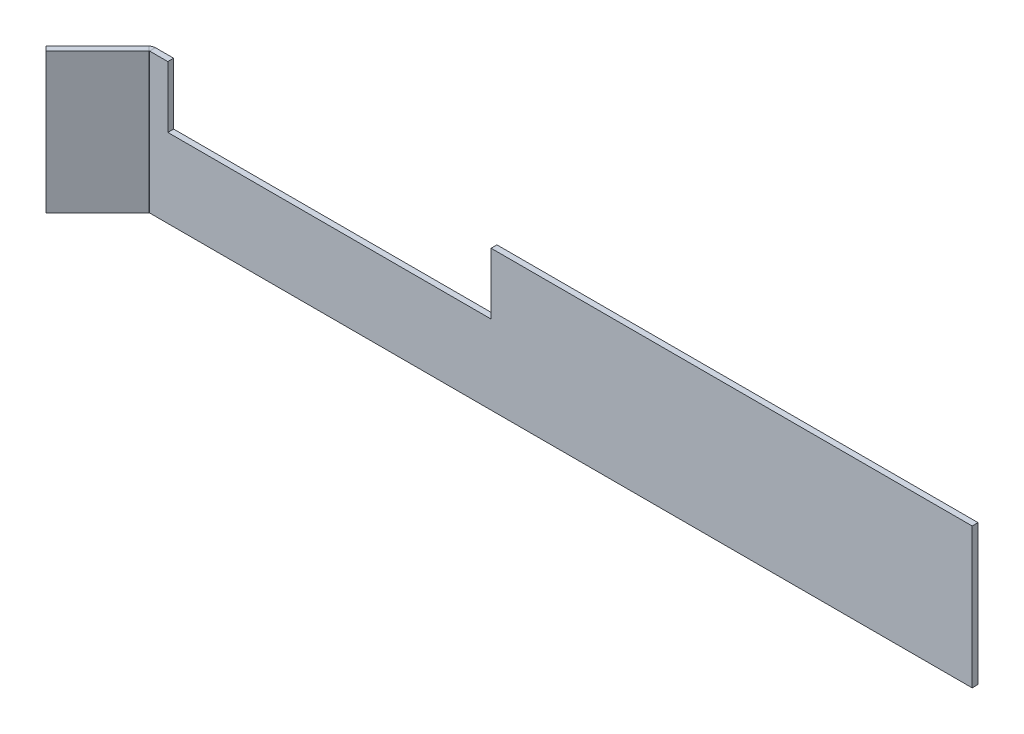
ISO-10303-21;
HEADER;
FILE_DESCRIPTION(('STEP AP214'),'2;1');
FILE_NAME('part.step','',(''),(''),'','','');
FILE_SCHEMA(('AUTOMOTIVE_DESIGN { 1 0 10303 214 1 1 1 1 }'));
ENDSEC;
DATA;
#1=APPLICATION_CONTEXT('core data for automotive mechanical design processes');
#2=APPLICATION_PROTOCOL_DEFINITION('international standard','automotive_design',2000,#1);
#3=PRODUCT_CONTEXT('',#1,'mechanical');
#4=PRODUCT('Part','Part','',(#3));
#5=PRODUCT_RELATED_PRODUCT_CATEGORY('part','',(#4));
#6=PRODUCT_DEFINITION_FORMATION('','',#4);
#7=PRODUCT_DEFINITION_CONTEXT('part definition',#1,'design');
#8=PRODUCT_DEFINITION('design','',#6,#7);
#9=PRODUCT_DEFINITION_SHAPE('','',#8);
#10=(LENGTH_UNIT() NAMED_UNIT(*) SI_UNIT(.MILLI.,.METRE.));
#11=(NAMED_UNIT(*) PLANE_ANGLE_UNIT() SI_UNIT($,.RADIAN.));
#12=(NAMED_UNIT(*) SI_UNIT($,.STERADIAN.) SOLID_ANGLE_UNIT());
#13=UNCERTAINTY_MEASURE_WITH_UNIT(LENGTH_MEASURE(1.E-05),#10,'distance_accuracy_value','');
#14=(GEOMETRIC_REPRESENTATION_CONTEXT(3) GLOBAL_UNCERTAINTY_ASSIGNED_CONTEXT((#13)) GLOBAL_UNIT_ASSIGNED_CONTEXT((#10,
#11,#12)) REPRESENTATION_CONTEXT('',''));
#15=CARTESIAN_POINT('',(0.,0.,0.));
#16=DIRECTION('',(0.,0.,1.));
#17=DIRECTION('',(1.,0.,0.));
#18=AXIS2_PLACEMENT_3D('',#15,#16,#17);
#19=CARTESIAN_POINT('',(0.,144.,6.));
#20=DIRECTION('',(0.,-1.,0.));
#21=DIRECTION('',(0.,0.,-1.));
#22=AXIS2_PLACEMENT_3D('',#19,#20,#21);
#23=PLANE('',#22);
#24=DIRECTION('',(-1.,0.,0.));
#25=VECTOR('',#24,1.);
#26=CARTESIAN_POINT('',(0.,144.,6.));
#27=LINE('',#26,#25);
#28=CARTESIAN_POINT('',(19.,144.,6.));
#29=VERTEX_POINT('',#28);
#30=CARTESIAN_POINT('',(0.305109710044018,144.,6.));
#31=VERTEX_POINT('',#30);
#32=EDGE_CURVE('E144',#29,#31,#27,.T.);
#33=ORIENTED_EDGE('',*,*,#32,.F.);
#34=DIRECTION('',(0.,0.,-1.));
#35=VECTOR('',#34,1.);
#36=CARTESIAN_POINT('',(19.,144.,10.));
#37=LINE('',#36,#35);
#38=CARTESIAN_POINT('',(19.,144.,0.));
#39=VERTEX_POINT('',#38);
#40=EDGE_CURVE('E134',#29,#39,#37,.T.);
#41=ORIENTED_EDGE('',*,*,#40,.T.);
#42=DIRECTION('',(-1.,0.,0.));
#43=VECTOR('',#42,1.);
#44=CARTESIAN_POINT('',(0.,144.,0.));
#45=LINE('',#44,#43);
#46=CARTESIAN_POINT('',(0.305109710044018,144.,0.));
#47=VERTEX_POINT('',#46);
#48=EDGE_CURVE('E64',#39,#47,#45,.T.);
#49=ORIENTED_EDGE('',*,*,#48,.T.);
#50=DIRECTION('',(0.,0.,-1.));
#51=VECTOR('',#50,1.);
#52=CARTESIAN_POINT('',(0.305109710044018,144.,6.));
#53=LINE('',#52,#51);
#54=EDGE_CURVE('E172',#31,#47,#53,.T.);
#55=ORIENTED_EDGE('',*,*,#54,.F.);
#56=EDGE_LOOP('',(#33,#41,#49,#55));
#57=FACE_BOUND('',#56,.T.);
#58=ADVANCED_FACE('F41',(#57),#23,.F.);
#59=CARTESIAN_POINT('',(0.,0.,6.));
#60=DIRECTION('',(0.,1.,0.));
#61=DIRECTION('',(0.,0.,1.));
#62=AXIS2_PLACEMENT_3D('',#59,#60,#61);
#63=PLANE('',#62);
#64=DIRECTION('',(0.,0.,-1.));
#65=VECTOR('',#64,1.);
#66=CARTESIAN_POINT('',(0.305109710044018,0.,6.));
#67=LINE('',#66,#65);
#68=CARTESIAN_POINT('',(0.305109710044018,0.,6.));
#69=VERTEX_POINT('',#68);
#70=CARTESIAN_POINT('',(0.305109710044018,0.,0.));
#71=VERTEX_POINT('',#70);
#72=EDGE_CURVE('E177',#69,#71,#67,.T.);
#73=ORIENTED_EDGE('',*,*,#72,.T.);
#74=DIRECTION('',(1.,0.,0.));
#75=VECTOR('',#74,1.);
#76=CARTESIAN_POINT('',(0.,0.,0.));
#77=LINE('',#76,#75);
#78=CARTESIAN_POINT('',(845.,0.,0.));
#79=VERTEX_POINT('',#78);
#80=EDGE_CURVE('E156',#71,#79,#77,.T.);
#81=ORIENTED_EDGE('',*,*,#80,.T.);
#82=DIRECTION('',(0.,0.,-1.));
#83=VECTOR('',#82,1.);
#84=CARTESIAN_POINT('',(845.,0.,6.));
#85=LINE('',#84,#83);
#86=CARTESIAN_POINT('',(845.,0.,6.));
#87=VERTEX_POINT('',#86);
#88=EDGE_CURVE('E11',#87,#79,#85,.T.);
#89=ORIENTED_EDGE('',*,*,#88,.F.);
#90=DIRECTION('',(1.,0.,0.));
#91=VECTOR('',#90,1.);
#92=CARTESIAN_POINT('',(0.,0.,6.));
#93=LINE('',#92,#91);
#94=EDGE_CURVE('E155',#69,#87,#93,.T.);
#95=ORIENTED_EDGE('',*,*,#94,.F.);
#96=EDGE_LOOP('',(#73,#81,#89,#95));
#97=FACE_BOUND('',#96,.T.);
#98=ADVANCED_FACE('F43',(#97),#63,.F.);
#99=CARTESIAN_POINT('',(845.,144.,0.));
#100=VERTEX_POINT('',#99);
#101=CARTESIAN_POINT('',(351.,144.,0.));
#102=VERTEX_POINT('',#101);
#103=EDGE_CURVE('E151',#100,#102,#45,.T.);
#104=ORIENTED_EDGE('',*,*,#103,.T.);
#105=DIRECTION('',(0.,0.,-1.));
#106=VECTOR('',#105,1.);
#107=CARTESIAN_POINT('',(351.,144.,10.));
#108=LINE('',#107,#106);
#109=CARTESIAN_POINT('',(351.,144.,6.));
#110=VERTEX_POINT('',#109);
#111=EDGE_CURVE('E56',#110,#102,#108,.T.);
#112=ORIENTED_EDGE('',*,*,#111,.F.);
#113=CARTESIAN_POINT('',(845.,144.,6.));
#114=VERTEX_POINT('',#113);
#115=EDGE_CURVE('E160',#114,#110,#27,.T.);
#116=ORIENTED_EDGE('',*,*,#115,.F.);
#117=DIRECTION('',(0.,0.,-1.));
#118=VECTOR('',#117,1.);
#119=CARTESIAN_POINT('',(845.,144.,6.));
#120=LINE('',#119,#118);
#121=EDGE_CURVE('E49',#114,#100,#120,.T.);
#122=ORIENTED_EDGE('',*,*,#121,.T.);
#123=EDGE_LOOP('',(#104,#112,#116,#122));
#124=FACE_BOUND('',#123,.T.);
#125=ADVANCED_FACE('F195',(#124),#23,.F.);
#126=CARTESIAN_POINT('',(0.,144.,6.));
#127=DIRECTION('',(0.,0.,-1.));
#128=DIRECTION('',(-1.,0.,0.));
#129=AXIS2_PLACEMENT_3D('',#126,#127,#128);
#130=PLANE('',#129);
#131=DIRECTION('',(-1.,0.,0.));
#132=VECTOR('',#131,1.);
#133=CARTESIAN_POINT('',(0.,81.,6.));
#134=LINE('',#133,#132);
#135=CARTESIAN_POINT('',(351.,81.,6.));
#136=VERTEX_POINT('',#135);
#137=CARTESIAN_POINT('',(19.,81.,6.));
#138=VERTEX_POINT('',#137);
#139=EDGE_CURVE('E203',#136,#138,#134,.T.);
#140=ORIENTED_EDGE('',*,*,#139,.T.);
#141=DIRECTION('',(0.,1.,0.));
#142=VECTOR('',#141,1.);
#143=CARTESIAN_POINT('',(19.,144.,6.));
#144=LINE('',#143,#142);
#145=EDGE_CURVE('E205',#138,#29,#144,.T.);
#146=ORIENTED_EDGE('',*,*,#145,.T.);
#147=ORIENTED_EDGE('',*,*,#32,.T.);
#148=DIRECTION('',(0.,-1.,0.));
#149=VECTOR('',#148,1.);
#150=CARTESIAN_POINT('',(0.305109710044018,0.,6.));
#151=LINE('',#150,#149);
#152=EDGE_CURVE('E244',#69,#31,#151,.F.);
#153=ORIENTED_EDGE('',*,*,#152,.F.);
#154=ORIENTED_EDGE('',*,*,#94,.T.);
#155=DIRECTION('',(0.,1.,0.));
#156=VECTOR('',#155,1.);
#157=CARTESIAN_POINT('',(845.,0.,6.));
#158=LINE('',#157,#156);
#159=EDGE_CURVE('E169',#87,#114,#158,.T.);
#160=ORIENTED_EDGE('',*,*,#159,.T.);
#161=ORIENTED_EDGE('',*,*,#115,.T.);
#162=DIRECTION('',(0.,-1.,0.));
#163=VECTOR('',#162,1.);
#164=CARTESIAN_POINT('',(351.,144.,6.));
#165=LINE('',#164,#163);
#166=EDGE_CURVE('E201',#110,#136,#165,.T.);
#167=ORIENTED_EDGE('',*,*,#166,.T.);
#168=EDGE_LOOP('',(#140,#146,#147,#153,#154,#160,#161,#167));
#169=FACE_BOUND('',#168,.T.);
#170=ADVANCED_FACE('F191',(#169),#130,.F.);
#171=CARTESIAN_POINT('',(0.,144.,0.));
#172=DIRECTION('',(0.,0.,-1.));
#173=DIRECTION('',(-1.,0.,0.));
#174=AXIS2_PLACEMENT_3D('',#171,#172,#173);
#175=PLANE('',#174);
#176=DIRECTION('',(0.,1.,0.));
#177=VECTOR('',#176,1.);
#178=CARTESIAN_POINT('',(19.,144.,0.));
#179=LINE('',#178,#177);
#180=CARTESIAN_POINT('',(19.,81.,0.));
#181=VERTEX_POINT('',#180);
#182=EDGE_CURVE('E132',#181,#39,#179,.T.);
#183=ORIENTED_EDGE('',*,*,#182,.F.);
#184=DIRECTION('',(-1.,0.,0.));
#185=VECTOR('',#184,1.);
#186=CARTESIAN_POINT('',(19.,81.,0.));
#187=LINE('',#186,#185);
#188=CARTESIAN_POINT('',(351.,81.,0.));
#189=VERTEX_POINT('',#188);
#190=EDGE_CURVE('E145',#189,#181,#187,.T.);
#191=ORIENTED_EDGE('',*,*,#190,.F.);
#192=DIRECTION('',(0.,-1.,0.));
#193=VECTOR('',#192,1.);
#194=CARTESIAN_POINT('',(351.,144.,0.));
#195=LINE('',#194,#193);
#196=EDGE_CURVE('E141',#102,#189,#195,.T.);
#197=ORIENTED_EDGE('',*,*,#196,.F.);
#198=ORIENTED_EDGE('',*,*,#103,.F.);
#199=DIRECTION('',(0.,1.,0.));
#200=VECTOR('',#199,1.);
#201=CARTESIAN_POINT('',(845.,0.,0.));
#202=LINE('',#201,#200);
#203=EDGE_CURVE('E152',#79,#100,#202,.T.);
#204=ORIENTED_EDGE('',*,*,#203,.F.);
#205=ORIENTED_EDGE('',*,*,#80,.F.);
#206=DIRECTION('',(0.,-1.,0.));
#207=VECTOR('',#206,1.);
#208=CARTESIAN_POINT('',(0.305109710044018,0.,0.));
#209=LINE('',#208,#207);
#210=EDGE_CURVE('E150',#71,#47,#209,.F.);
#211=ORIENTED_EDGE('',*,*,#210,.T.);
#212=ORIENTED_EDGE('',*,*,#48,.F.);
#213=EDGE_LOOP('',(#183,#191,#197,#198,#204,#205,#211,#212));
#214=FACE_BOUND('',#213,.T.);
#215=ADVANCED_FACE('F148',(#214),#175,.T.);
#216=CARTESIAN_POINT('',(845.,0.,6.));
#217=DIRECTION('',(-1.,0.,0.));
#218=DIRECTION('',(0.,0.,1.));
#219=AXIS2_PLACEMENT_3D('',#216,#217,#218);
#220=PLANE('',#219);
#221=ORIENTED_EDGE('',*,*,#203,.T.);
#222=ORIENTED_EDGE('',*,*,#121,.F.);
#223=ORIENTED_EDGE('',*,*,#159,.F.);
#224=ORIENTED_EDGE('',*,*,#88,.T.);
#225=EDGE_LOOP('',(#221,#222,#223,#224));
#226=FACE_BOUND('',#225,.T.);
#227=ADVANCED_FACE('F193',(#226),#220,.F.);
#228=CARTESIAN_POINT('',(0.305109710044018,144.,6.7366));
#229=DIRECTION('',(0.,1.,0.));
#230=DIRECTION('',(0.,0.,1.));
#231=AXIS2_PLACEMENT_3D('',#228,#229,#230);
#232=PLANE('',#231);
#233=DIRECTION('',(-0.707106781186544,0.,-0.707106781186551));
#234=VECTOR('',#233,1.);
#235=CARTESIAN_POINT('',(-0.215745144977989,144.,6.21574514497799));
#236=LINE('',#235,#234);
#237=CARTESIAN_POINT('',(-0.215745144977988,144.,6.21574514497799));
#238=VERTEX_POINT('',#237);
#239=CARTESIAN_POINT('',(-4.45838583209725,144.,1.97310445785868));
#240=VERTEX_POINT('',#239);
#241=EDGE_CURVE('E207',#238,#240,#236,.T.);
#242=ORIENTED_EDGE('',*,*,#241,.F.);
#243=CARTESIAN_POINT('',(0.305109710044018,144.,6.7366));
#244=DIRECTION('',(0.,-1.,0.));
#245=DIRECTION('',(0.,0.,-1.));
#246=AXIS2_PLACEMENT_3D('',#243,#244,#245);
#247=CIRCLE('',#246,0.736599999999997);
#248=EDGE_CURVE('E242',#31,#238,#247,.F.);
#249=ORIENTED_EDGE('',*,*,#248,.F.);
#250=ORIENTED_EDGE('',*,*,#54,.T.);
#251=CARTESIAN_POINT('',(0.305109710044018,144.,6.7366));
#252=DIRECTION('',(0.,-1.,0.));
#253=DIRECTION('',(0.,0.,-1.));
#254=AXIS2_PLACEMENT_3D('',#251,#252,#253);
#255=CIRCLE('',#254,6.7366);
#256=EDGE_CURVE('E182',#47,#240,#255,.F.);
#257=ORIENTED_EDGE('',*,*,#256,.T.);
#258=EDGE_LOOP('',(#242,#249,#250,#257));
#259=FACE_BOUND('',#258,.T.);
#260=ADVANCED_FACE('F286',(#259),#232,.T.);
#261=CARTESIAN_POINT('',(0.305109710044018,0.,6.7366));
#262=DIRECTION('',(0.,1.,0.));
#263=DIRECTION('',(0.,0.,1.));
#264=AXIS2_PLACEMENT_3D('',#261,#262,#263);
#265=PLANE('',#264);
#266=CARTESIAN_POINT('',(0.305109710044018,0.,6.7366));
#267=DIRECTION('',(0.,-1.,0.));
#268=DIRECTION('',(0.,0.,-1.));
#269=AXIS2_PLACEMENT_3D('',#266,#267,#268);
#270=CIRCLE('',#269,0.736599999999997);
#271=CARTESIAN_POINT('',(-0.215745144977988,0.,6.21574514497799));
#272=VERTEX_POINT('',#271);
#273=EDGE_CURVE('E185',#272,#69,#270,.T.);
#274=ORIENTED_EDGE('',*,*,#273,.F.);
#275=DIRECTION('',(-0.707106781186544,0.,-0.707106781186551));
#276=VECTOR('',#275,1.);
#277=CARTESIAN_POINT('',(-0.215745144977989,0.,6.21574514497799));
#278=LINE('',#277,#276);
#279=CARTESIAN_POINT('',(-4.45838583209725,0.,1.97310445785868));
#280=VERTEX_POINT('',#279);
#281=EDGE_CURVE('E210',#272,#280,#278,.T.);
#282=ORIENTED_EDGE('',*,*,#281,.T.);
#283=CARTESIAN_POINT('',(0.305109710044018,0.,6.7366));
#284=DIRECTION('',(0.,-1.,0.));
#285=DIRECTION('',(0.,0.,-1.));
#286=AXIS2_PLACEMENT_3D('',#283,#284,#285);
#287=CIRCLE('',#286,6.7366);
#288=EDGE_CURVE('E238',#280,#71,#287,.T.);
#289=ORIENTED_EDGE('',*,*,#288,.T.);
#290=ORIENTED_EDGE('',*,*,#72,.F.);
#291=EDGE_LOOP('',(#274,#282,#289,#290));
#292=FACE_BOUND('',#291,.T.);
#293=ADVANCED_FACE('F282',(#292),#265,.F.);
#294=CARTESIAN_POINT('',(0.305109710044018,0.,6.7366));
#295=DIRECTION('',(0.,-1.,0.));
#296=DIRECTION('',(-0.707106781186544,0.,-0.707106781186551));
#297=AXIS2_PLACEMENT_3D('',#294,#295,#296);
#298=CYLINDRICAL_SURFACE('',#297,6.7366);
#299=ORIENTED_EDGE('',*,*,#210,.F.);
#300=ORIENTED_EDGE('',*,*,#288,.F.);
#301=DIRECTION('',(0.,1.,0.));
#302=VECTOR('',#301,1.);
#303=CARTESIAN_POINT('',(-4.45838583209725,144.,1.97310445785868));
#304=LINE('',#303,#302);
#305=EDGE_CURVE('E213',#280,#240,#304,.T.);
#306=ORIENTED_EDGE('',*,*,#305,.T.);
#307=ORIENTED_EDGE('',*,*,#256,.F.);
#308=EDGE_LOOP('',(#299,#300,#306,#307));
#309=FACE_BOUND('',#308,.T.);
#310=ADVANCED_FACE('F285',(#309),#298,.T.);
#311=CARTESIAN_POINT('',(0.305109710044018,0.,6.7366));
#312=DIRECTION('',(0.,-1.,0.));
#313=DIRECTION('',(-0.707106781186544,0.,-0.707106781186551));
#314=AXIS2_PLACEMENT_3D('',#311,#312,#313);
#315=CYLINDRICAL_SURFACE('',#314,0.736599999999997);
#316=ORIENTED_EDGE('',*,*,#152,.T.);
#317=ORIENTED_EDGE('',*,*,#248,.T.);
#318=DIRECTION('',(0.,-1.,0.));
#319=VECTOR('',#318,1.);
#320=CARTESIAN_POINT('',(-0.215745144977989,144.,6.21574514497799));
#321=LINE('',#320,#319);
#322=EDGE_CURVE('E208',#238,#272,#321,.T.);
#323=ORIENTED_EDGE('',*,*,#322,.T.);
#324=ORIENTED_EDGE('',*,*,#273,.T.);
#325=EDGE_LOOP('',(#316,#317,#323,#324));
#326=FACE_BOUND('',#325,.T.);
#327=ADVANCED_FACE('F249',(#326),#315,.F.);
#328=CARTESIAN_POINT('',(-4.24264068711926,144.,1.75735931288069));
#329=DIRECTION('',(0.,-1.,0.));
#330=DIRECTION('',(0.,0.,-1.));
#331=AXIS2_PLACEMENT_3D('',#328,#329,#330);
#332=PLANE('',#331);
#333=ORIENTED_EDGE('',*,*,#241,.T.);
#334=DIRECTION('',(0.707106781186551,0.,-0.707106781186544));
#335=VECTOR('',#334,1.);
#336=CARTESIAN_POINT('',(-4.24264068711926,144.,1.75735931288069));
#337=LINE('',#336,#335);
#338=CARTESIAN_POINT('',(-57.2756492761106,144.,54.7903679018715));
#339=VERTEX_POINT('',#338);
#340=EDGE_CURVE('E218',#339,#240,#337,.T.);
#341=ORIENTED_EDGE('',*,*,#340,.F.);
#342=DIRECTION('',(0.707106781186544,0.,0.707106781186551));
#343=VECTOR('',#342,1.);
#344=CARTESIAN_POINT('',(-57.2756492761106,144.,54.7903679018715));
#345=LINE('',#344,#343);
#346=CARTESIAN_POINT('',(-53.0330085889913,144.,59.0330085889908));
#347=VERTEX_POINT('',#346);
#348=EDGE_CURVE('E226',#339,#347,#345,.T.);
#349=ORIENTED_EDGE('',*,*,#348,.T.);
#350=DIRECTION('',(0.707106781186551,0.,-0.707106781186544));
#351=VECTOR('',#350,1.);
#352=CARTESIAN_POINT('',(0.,144.,6.));
#353=LINE('',#352,#351);
#354=EDGE_CURVE('E217',#347,#238,#353,.T.);
#355=ORIENTED_EDGE('',*,*,#354,.T.);
#356=EDGE_LOOP('',(#333,#341,#349,#355));
#357=FACE_BOUND('',#356,.T.);
#358=ADVANCED_FACE('F291',(#357),#332,.F.);
#359=CARTESIAN_POINT('',(-57.2756492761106,0.,54.7903679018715));
#360=DIRECTION('',(0.,1.,0.));
#361=DIRECTION('',(0.,0.,1.));
#362=AXIS2_PLACEMENT_3D('',#359,#360,#361);
#363=PLANE('',#362);
#364=ORIENTED_EDGE('',*,*,#281,.F.);
#365=DIRECTION('',(-0.707106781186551,0.,0.707106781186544));
#366=VECTOR('',#365,1.);
#367=CARTESIAN_POINT('',(-53.0330085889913,0.,59.0330085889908));
#368=LINE('',#367,#366);
#369=CARTESIAN_POINT('',(-53.0330085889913,0.,59.0330085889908));
#370=VERTEX_POINT('',#369);
#371=EDGE_CURVE('E229',#272,#370,#368,.T.);
#372=ORIENTED_EDGE('',*,*,#371,.T.);
#373=DIRECTION('',(0.707106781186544,0.,0.707106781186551));
#374=VECTOR('',#373,1.);
#375=CARTESIAN_POINT('',(-57.2756492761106,0.,54.7903679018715));
#376=LINE('',#375,#374);
#377=CARTESIAN_POINT('',(-57.2756492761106,0.,54.7903679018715));
#378=VERTEX_POINT('',#377);
#379=EDGE_CURVE('E234',#378,#370,#376,.T.);
#380=ORIENTED_EDGE('',*,*,#379,.F.);
#381=DIRECTION('',(-0.707106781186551,0.,0.707106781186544));
#382=VECTOR('',#381,1.);
#383=CARTESIAN_POINT('',(-57.2756492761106,0.,54.7903679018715));
#384=LINE('',#383,#382);
#385=EDGE_CURVE('E221',#280,#378,#384,.T.);
#386=ORIENTED_EDGE('',*,*,#385,.F.);
#387=EDGE_LOOP('',(#364,#372,#380,#386));
#388=FACE_BOUND('',#387,.T.);
#389=ADVANCED_FACE('F297',(#388),#363,.F.);
#390=CARTESIAN_POINT('',(-57.2756492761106,144.,54.7903679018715));
#391=DIRECTION('',(0.707106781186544,0.,0.707106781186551));
#392=DIRECTION('',(0.707106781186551,0.,-0.707106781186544));
#393=AXIS2_PLACEMENT_3D('',#390,#391,#392);
#394=PLANE('',#393);
#395=ORIENTED_EDGE('',*,*,#305,.F.);
#396=ORIENTED_EDGE('',*,*,#385,.T.);
#397=DIRECTION('',(0.,1.,0.));
#398=VECTOR('',#397,1.);
#399=CARTESIAN_POINT('',(-57.2756492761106,144.,54.7903679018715));
#400=LINE('',#399,#398);
#401=EDGE_CURVE('E224',#378,#339,#400,.T.);
#402=ORIENTED_EDGE('',*,*,#401,.T.);
#403=ORIENTED_EDGE('',*,*,#340,.T.);
#404=EDGE_LOOP('',(#395,#396,#402,#403));
#405=FACE_BOUND('',#404,.T.);
#406=ADVANCED_FACE('F301',(#405),#394,.F.);
#407=CARTESIAN_POINT('',(-53.0330085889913,144.,59.0330085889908));
#408=DIRECTION('',(0.707106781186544,0.,0.707106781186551));
#409=DIRECTION('',(0.707106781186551,0.,-0.707106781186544));
#410=AXIS2_PLACEMENT_3D('',#407,#408,#409);
#411=PLANE('',#410);
#412=ORIENTED_EDGE('',*,*,#371,.F.);
#413=ORIENTED_EDGE('',*,*,#322,.F.);
#414=ORIENTED_EDGE('',*,*,#354,.F.);
#415=DIRECTION('',(0.,1.,0.));
#416=VECTOR('',#415,1.);
#417=CARTESIAN_POINT('',(-53.0330085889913,144.,59.0330085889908));
#418=LINE('',#417,#416);
#419=EDGE_CURVE('E222',#370,#347,#418,.T.);
#420=ORIENTED_EDGE('',*,*,#419,.F.);
#421=EDGE_LOOP('',(#412,#413,#414,#420));
#422=FACE_BOUND('',#421,.T.);
#423=ADVANCED_FACE('F305',(#422),#411,.T.);
#424=CARTESIAN_POINT('',(-57.2756492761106,144.,54.7903679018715));
#425=DIRECTION('',(0.707106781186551,0.,-0.707106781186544));
#426=DIRECTION('',(-0.707106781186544,0.,-0.707106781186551));
#427=AXIS2_PLACEMENT_3D('',#424,#425,#426);
#428=PLANE('',#427);
#429=ORIENTED_EDGE('',*,*,#419,.T.);
#430=ORIENTED_EDGE('',*,*,#348,.F.);
#431=ORIENTED_EDGE('',*,*,#401,.F.);
#432=ORIENTED_EDGE('',*,*,#379,.T.);
#433=EDGE_LOOP('',(#429,#430,#431,#432));
#434=FACE_BOUND('',#433,.T.);
#435=ADVANCED_FACE('F303',(#434),#428,.F.);
#436=CARTESIAN_POINT('',(19.,144.,10.));
#437=DIRECTION('',(-1.,0.,0.));
#438=DIRECTION('',(0.,0.,1.));
#439=AXIS2_PLACEMENT_3D('',#436,#437,#438);
#440=PLANE('',#439);
#441=DIRECTION('',(0.,0.,-1.));
#442=VECTOR('',#441,1.);
#443=CARTESIAN_POINT('',(19.,81.,10.));
#444=LINE('',#443,#442);
#445=EDGE_CURVE('E137',#138,#181,#444,.T.);
#446=ORIENTED_EDGE('',*,*,#445,.T.);
#447=ORIENTED_EDGE('',*,*,#182,.T.);
#448=ORIENTED_EDGE('',*,*,#40,.F.);
#449=ORIENTED_EDGE('',*,*,#145,.F.);
#450=EDGE_LOOP('',(#446,#447,#448,#449));
#451=FACE_BOUND('',#450,.T.);
#452=ADVANCED_FACE('F133',(#451),#440,.F.);
#453=CARTESIAN_POINT('',(19.,81.,10.));
#454=DIRECTION('',(0.,-1.,0.));
#455=DIRECTION('',(1.,0.,0.));
#456=AXIS2_PLACEMENT_3D('',#453,#454,#455);
#457=PLANE('',#456);
#458=DIRECTION('',(0.,0.,-1.));
#459=VECTOR('',#458,1.);
#460=CARTESIAN_POINT('',(351.,81.,10.));
#461=LINE('',#460,#459);
#462=EDGE_CURVE('E196',#136,#189,#461,.T.);
#463=ORIENTED_EDGE('',*,*,#462,.T.);
#464=ORIENTED_EDGE('',*,*,#190,.T.);
#465=ORIENTED_EDGE('',*,*,#445,.F.);
#466=ORIENTED_EDGE('',*,*,#139,.F.);
#467=EDGE_LOOP('',(#463,#464,#465,#466));
#468=FACE_BOUND('',#467,.T.);
#469=ADVANCED_FACE('F257',(#468),#457,.F.);
#470=CARTESIAN_POINT('',(351.,144.,10.));
#471=DIRECTION('',(1.,0.,0.));
#472=DIRECTION('',(0.,0.,-1.));
#473=AXIS2_PLACEMENT_3D('',#470,#471,#472);
#474=PLANE('',#473);
#475=ORIENTED_EDGE('',*,*,#111,.T.);
#476=ORIENTED_EDGE('',*,*,#196,.T.);
#477=ORIENTED_EDGE('',*,*,#462,.F.);
#478=ORIENTED_EDGE('',*,*,#166,.F.);
#479=EDGE_LOOP('',(#475,#476,#477,#478));
#480=FACE_BOUND('',#479,.T.);
#481=ADVANCED_FACE('F258',(#480),#474,.F.);
#482=CLOSED_SHELL('',(#58,#98,#125,#170,#215,#227,#260,#293,#310,#327,#358,#389,#406,#423,#435,
#452,#469,#481));
#483=MANIFOLD_SOLID_BREP('B2',#482);
#484=ADVANCED_BREP_SHAPE_REPRESENTATION('',(#18,#483),#14);
#485=SHAPE_DEFINITION_REPRESENTATION(#9,#484);
ENDSEC;
END-ISO-10303-21;
